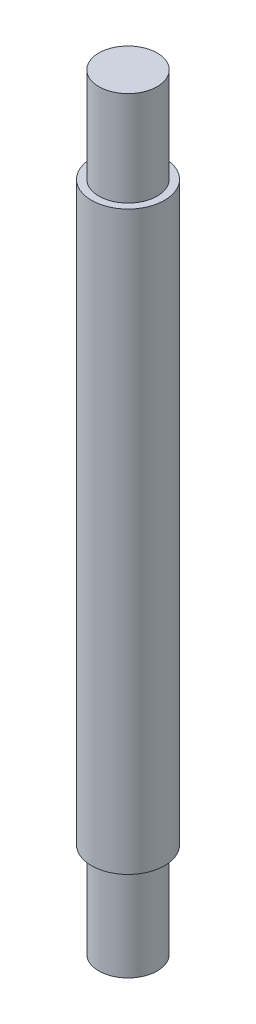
ISO-10303-21;
HEADER;
FILE_DESCRIPTION(('STEP AP214'),'2;1');
FILE_NAME('part.step','',(''),(''),'','','');
FILE_SCHEMA(('AUTOMOTIVE_DESIGN { 1 0 10303 214 1 1 1 1 }'));
ENDSEC;
DATA;
#1=APPLICATION_CONTEXT('core data for automotive mechanical design processes');
#2=APPLICATION_PROTOCOL_DEFINITION('international standard','automotive_design',2000,#1);
#3=PRODUCT_CONTEXT('',#1,'mechanical');
#4=PRODUCT('Part','Part','',(#3));
#5=PRODUCT_RELATED_PRODUCT_CATEGORY('part','',(#4));
#6=PRODUCT_DEFINITION_FORMATION('','',#4);
#7=PRODUCT_DEFINITION_CONTEXT('part definition',#1,'design');
#8=PRODUCT_DEFINITION('design','',#6,#7);
#9=PRODUCT_DEFINITION_SHAPE('','',#8);
#10=(LENGTH_UNIT() NAMED_UNIT(*) SI_UNIT(.MILLI.,.METRE.));
#11=(NAMED_UNIT(*) PLANE_ANGLE_UNIT() SI_UNIT($,.RADIAN.));
#12=(NAMED_UNIT(*) SI_UNIT($,.STERADIAN.) SOLID_ANGLE_UNIT());
#13=UNCERTAINTY_MEASURE_WITH_UNIT(LENGTH_MEASURE(1.E-05),#10,'distance_accuracy_value','');
#14=(GEOMETRIC_REPRESENTATION_CONTEXT(3) GLOBAL_UNCERTAINTY_ASSIGNED_CONTEXT((#13)) GLOBAL_UNIT_ASSIGNED_CONTEXT((#10,
#11,#12)) REPRESENTATION_CONTEXT('',''));
#15=CARTESIAN_POINT('',(0.,0.,0.));
#16=DIRECTION('',(0.,0.,1.));
#17=DIRECTION('',(1.,0.,0.));
#18=AXIS2_PLACEMENT_3D('',#15,#16,#17);
#19=CARTESIAN_POINT('',(0.,-52.5,0.));
#20=DIRECTION('',(0.,-1.,0.));
#21=DIRECTION('',(0.,0.,-1.));
#22=AXIS2_PLACEMENT_3D('',#19,#20,#21);
#23=PLANE('',#22);
#24=CARTESIAN_POINT('',(0.,-52.5,0.));
#25=DIRECTION('',(0.,-1.,0.));
#26=DIRECTION('',(0.,0.,-1.));
#27=AXIS2_PLACEMENT_3D('',#24,#25,#26);
#28=CIRCLE('',#27,3.99999999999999);
#29=CARTESIAN_POINT('',(0.,-52.5,-3.99999999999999));
#30=VERTEX_POINT('',#29);
#31=EDGE_CURVE('E10',#30,#30,#28,.T.);
#32=ORIENTED_EDGE('',*,*,#31,.T.);
#33=EDGE_LOOP('',(#32));
#34=FACE_BOUND('',#33,.T.);
#35=ADVANCED_FACE('F39',(#34),#23,.T.);
#36=CARTESIAN_POINT('',(0.,0.,0.));
#37=DIRECTION('',(0.,-1.,0.));
#38=DIRECTION('',(0.,0.,-1.));
#39=AXIS2_PLACEMENT_3D('',#36,#37,#38);
#40=CYLINDRICAL_SURFACE('',#39,3.99999999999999);
#41=CARTESIAN_POINT('',(0.,-39.5,0.));
#42=DIRECTION('',(0.,-1.,0.));
#43=DIRECTION('',(0.,0.,-1.));
#44=AXIS2_PLACEMENT_3D('',#41,#42,#43);
#45=CIRCLE('',#44,3.99999999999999);
#46=CARTESIAN_POINT('',(0.,-39.5,-3.99999999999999));
#47=VERTEX_POINT('',#46);
#48=EDGE_CURVE('E46',#47,#47,#45,.T.);
#49=ORIENTED_EDGE('',*,*,#48,.T.);
#50=EDGE_LOOP('',(#49));
#51=FACE_BOUND('',#50,.T.);
#52=ORIENTED_EDGE('',*,*,#31,.F.);
#53=EDGE_LOOP('',(#52));
#54=FACE_BOUND('',#53,.T.);
#55=ADVANCED_FACE('F86',(#51,#54),#40,.T.);
#56=CARTESIAN_POINT('',(3.99999999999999,-39.5,0.));
#57=DIRECTION('',(0.,-1.,0.));
#58=DIRECTION('',(0.,0.,-1.));
#59=AXIS2_PLACEMENT_3D('',#56,#57,#58);
#60=PLANE('',#59);
#61=CARTESIAN_POINT('',(0.,-39.5,0.));
#62=DIRECTION('',(0.,-1.,0.));
#63=DIRECTION('',(0.,0.,-1.));
#64=AXIS2_PLACEMENT_3D('',#61,#62,#63);
#65=CIRCLE('',#64,4.99999999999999);
#66=CARTESIAN_POINT('',(0.,-39.5,-4.99999999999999));
#67=VERTEX_POINT('',#66);
#68=EDGE_CURVE('E52',#67,#67,#65,.T.);
#69=ORIENTED_EDGE('',*,*,#68,.T.);
#70=EDGE_LOOP('',(#69));
#71=FACE_BOUND('',#70,.T.);
#72=ORIENTED_EDGE('',*,*,#48,.F.);
#73=EDGE_LOOP('',(#72));
#74=FACE_BOUND('',#73,.T.);
#75=ADVANCED_FACE('F90',(#71,#74),#60,.T.);
#76=CARTESIAN_POINT('',(0.,0.,0.));
#77=DIRECTION('',(0.,-1.,0.));
#78=DIRECTION('',(0.,0.,-1.));
#79=AXIS2_PLACEMENT_3D('',#76,#77,#78);
#80=CYLINDRICAL_SURFACE('',#79,4.99999999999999);
#81=CARTESIAN_POINT('',(0.,39.5,0.));
#82=DIRECTION('',(0.,-1.,0.));
#83=DIRECTION('',(0.,0.,-1.));
#84=AXIS2_PLACEMENT_3D('',#81,#82,#83);
#85=CIRCLE('',#84,4.99999999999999);
#86=CARTESIAN_POINT('',(0.,39.5,-4.99999999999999));
#87=VERTEX_POINT('',#86);
#88=EDGE_CURVE('E58',#87,#87,#85,.T.);
#89=ORIENTED_EDGE('',*,*,#88,.T.);
#90=EDGE_LOOP('',(#89));
#91=FACE_BOUND('',#90,.T.);
#92=ORIENTED_EDGE('',*,*,#68,.F.);
#93=EDGE_LOOP('',(#92));
#94=FACE_BOUND('',#93,.T.);
#95=ADVANCED_FACE('F94',(#91,#94),#80,.T.);
#96=CARTESIAN_POINT('',(3.99999999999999,39.5,0.));
#97=DIRECTION('',(0.,1.,0.));
#98=DIRECTION('',(0.,0.,1.));
#99=AXIS2_PLACEMENT_3D('',#96,#97,#98);
#100=PLANE('',#99);
#101=CARTESIAN_POINT('',(0.,39.5,0.));
#102=DIRECTION('',(0.,-1.,0.));
#103=DIRECTION('',(0.,0.,-1.));
#104=AXIS2_PLACEMENT_3D('',#101,#102,#103);
#105=CIRCLE('',#104,3.99999999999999);
#106=CARTESIAN_POINT('',(0.,39.5,-3.99999999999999));
#107=VERTEX_POINT('',#106);
#108=EDGE_CURVE('E64',#107,#107,#105,.T.);
#109=ORIENTED_EDGE('',*,*,#108,.T.);
#110=EDGE_LOOP('',(#109));
#111=FACE_BOUND('',#110,.T.);
#112=ORIENTED_EDGE('',*,*,#88,.F.);
#113=EDGE_LOOP('',(#112));
#114=FACE_BOUND('',#113,.T.);
#115=ADVANCED_FACE('F83',(#111,#114),#100,.T.);
#116=CARTESIAN_POINT('',(0.,0.,0.));
#117=DIRECTION('',(0.,-1.,0.));
#118=DIRECTION('',(0.,0.,-1.));
#119=AXIS2_PLACEMENT_3D('',#116,#117,#118);
#120=CYLINDRICAL_SURFACE('',#119,3.99999999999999);
#121=CARTESIAN_POINT('',(0.,52.5,0.));
#122=DIRECTION('',(0.,-1.,0.));
#123=DIRECTION('',(0.,0.,-1.));
#124=AXIS2_PLACEMENT_3D('',#121,#122,#123);
#125=CIRCLE('',#124,3.99999999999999);
#126=CARTESIAN_POINT('',(0.,52.5,-3.99999999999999));
#127=VERTEX_POINT('',#126);
#128=EDGE_CURVE('E68',#127,#127,#125,.T.);
#129=ORIENTED_EDGE('',*,*,#128,.T.);
#130=EDGE_LOOP('',(#129));
#131=FACE_BOUND('',#130,.T.);
#132=ORIENTED_EDGE('',*,*,#108,.F.);
#133=EDGE_LOOP('',(#132));
#134=FACE_BOUND('',#133,.T.);
#135=ADVANCED_FACE('F74',(#131,#134),#120,.T.);
#136=CARTESIAN_POINT('',(0.,52.5,0.));
#137=DIRECTION('',(0.,1.,0.));
#138=DIRECTION('',(0.,0.,1.));
#139=AXIS2_PLACEMENT_3D('',#136,#137,#138);
#140=PLANE('',#139);
#141=ORIENTED_EDGE('',*,*,#128,.F.);
#142=EDGE_LOOP('',(#141));
#143=FACE_BOUND('',#142,.T.);
#144=ADVANCED_FACE('F77',(#143),#140,.T.);
#145=CLOSED_SHELL('',(#35,#55,#75,#95,#115,#135,#144));
#146=MANIFOLD_SOLID_BREP('B2',#145);
#147=ADVANCED_BREP_SHAPE_REPRESENTATION('',(#18,#146),#14);
#148=SHAPE_DEFINITION_REPRESENTATION(#9,#147);
ENDSEC;
END-ISO-10303-21;
